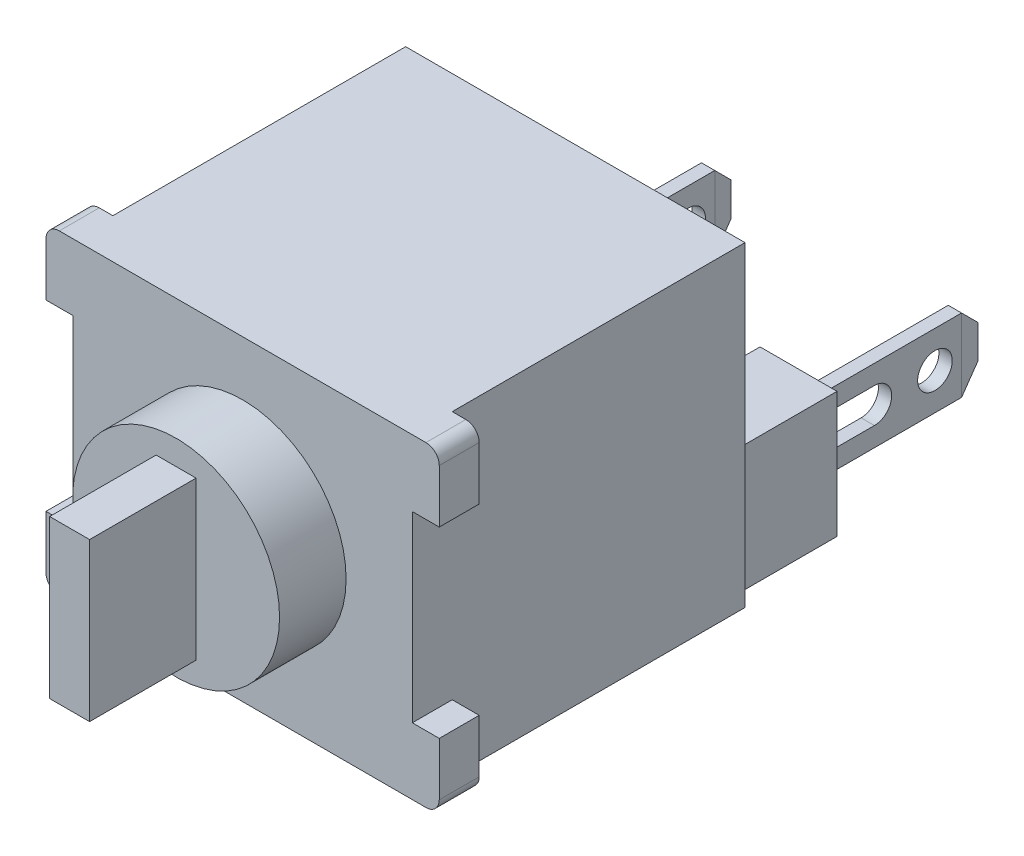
from build123d import *
from OCP.BRepFilletAPI import BRepFilletAPI_MakeChamfer

# Parameters (mm, degrees)
SKETCH1_W                          = 12.954
SKETCH1_H                          = 12.065
EXTRUDE1_DEPTH                     = 12.7
SKETCH2_W                          = 2.939197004
SKETCH2_H                          = 4.798107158
STANDOFF_DEPTH                     = 3.81
SKETCH3_W                          = 0.508
SKETCH3_H                          = 2.794
METAL_DEPTH                        = 6.731
WIRE_HOLE_REACH                    = 20.127
SKETCH4_R                          = 0.6604
CHAMFER1_SIZE                      = 0.762
CHAMFER2_SIZE                      = 0.762
CHAMFER2_SIZE2                     = 0.134361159
CHAMFER1_OF_CONNECTOR_MIRROR_SIZE  = 0.762
CHAMFER2_OF_CONNECTOR_MIRROR_SIZE  = 0.762
CHAMFER2_OF_CONNECTOR_MIRROR_SIZE2 = 0.134361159
SKETCH5_W                          = 1.0287
SKETCH5_H                          = 2.54
TABS_DEPTH                         = 1.524
FILLET1_R                          = 0.508
TEXT_2_DEPTH                       = 0.254
SKETCH7_R                          = 3.9497
PLUNGER_DEPTH                      = 2.54
SKETCH8_W                          = 1.524
SKETCH8_H                          = 6.0198
PLUNGER_I_DEPTH                    = 4.064


with BuildPart() as part:
    # Sketch1 → Extrude1 (new body)
    with BuildSketch(Plane.XY):
        Rectangle(SKETCH1_W, SKETCH1_H)
    extrude(amount=EXTRUDE1_DEPTH)

    # Sketch2 → standoff (add)
    with BuildSketch(Plane(origin=(0, 0, 0), x_dir=(-1, 0, 0), z_dir=(0, 0, -1))):
        with Locations((4.710259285, -3.336304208)):
            Rectangle(SKETCH2_W, SKETCH2_H)
    standoff = extrude(amount=STANDOFF_DEPTH)

    # Sketch3 → metal (add)
    with BuildSketch(Plane(origin=(0, 0, -3.81), x_dir=(-1, 0, 0), z_dir=(0, 0, -1))):
        with Locations((4.710259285, -3.336304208)):
            Rectangle(SKETCH3_W, SKETCH3_H)
    metal = extrude(amount=METAL_DEPTH)

    # Sketch4 → wire hole (cut, up to next)
    with BuildSketch(Plane.ZY.offset(4.964259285), mode=Mode.PRIVATE) as wire_hole_sk1:
        with Locations((-8.763, -3.336304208)):
            Circle(SKETCH4_R)
    wire_hole_tool1 = extrude(wire_hole_sk1.sketch, amount=-WIRE_HOLE_REACH, mode=Mode.PRIVATE) & part.part
    # Sketch4 → wire hole (cut, up to next)
    with BuildSketch(Plane.ZY.offset(4.964259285), mode=Mode.PRIVATE) as wire_hole_sk2:
        with BuildLine():
            Line((-4.4704, -3.996704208), (-6.4516, -3.996704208))
            ThreePointArc((-6.4516, -3.996704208), (-7.112, -3.336304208), (-6.4516, -2.675904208))
            Line((-6.4516, -2.675904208), (-4.4704, -2.675904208))
            ThreePointArc((-4.4704, -2.675904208), (-3.81, -3.336304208), (-4.4704, -3.996704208))
        make_face()
    wire_hole_tool2 = extrude(wire_hole_sk2.sketch, amount=-WIRE_HOLE_REACH, mode=Mode.PRIVATE) & part.part
    wire_hole_1 = wire_hole_tool1.solids().sort_by_distance((-4.964259, -3.336304, -8.763))[0]
    add(wire_hole_1, mode=Mode.SUBTRACT)
    wire_hole_2 = wire_hole_tool2.solids().sort_by_distance((-4.964259, -3.336304, -5.461))[0]
    add(wire_hole_2, mode=Mode.SUBTRACT)
    wire_hole = wire_hole_1 + wire_hole_2  # wire hole as one shape, for the pattern or mirror that repeats it

    # Chamfer1
    chamfer1_edges = [part.edges().sort_by_distance(p)[0] for p in [
        (-4.710259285, -1.939304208, -10.541),
        (-4.710259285, -4.733304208, -10.541),
    ]]
    chamfer(chamfer1_edges, length=CHAMFER1_SIZE)

    # Chamfer2: one chamfer whose edges measure the first distance from different faces: ONE call of the kernel's chamfer builder (chamfer() names one face for all edges)
    chamfer2_edges_1 = [part.edges().sort_by_distance(p)[0] for p in [
        (-4.456259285, -3.336304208, -10.541),
    ]]
    chamfer2_side_1 = [part.faces().sort_by_distance(p)[0] for p in [
        (-4.456259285, -3.336304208, -7.397261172),
    ]]
    chamfer2_edges_2 = [part.edges().sort_by_distance(p)[0] for p in [
        (-4.964259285, -3.336304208, -10.541),
    ]]
    chamfer2_side_2 = [part.faces().sort_by_distance(p)[0] for p in [
        (-4.964259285, -3.336304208, -7.397261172),
    ]]
    chamfer2 = BRepFilletAPI_MakeChamfer(part.part.solid().wrapped)
    for e in chamfer2_edges_1:
        chamfer2.Add(CHAMFER2_SIZE, CHAMFER2_SIZE2, e.wrapped, chamfer2_side_1[0].wrapped)  # the first distance lies on this face
    for e in chamfer2_edges_2:
        chamfer2.Add(CHAMFER2_SIZE, CHAMFER2_SIZE2, e.wrapped, chamfer2_side_2[0].wrapped)  # the first distance lies on this face
    add(Compound.cast(chamfer2.Shape()), mode=Mode.REPLACE)

    # connector mirror: standoff, metal, wire hole across plane
    add(standoff.mirror(Plane(origin=(0, 0, 0), x_dir=(0, 0, 1), z_dir=(1, 0, 0))))
    add(metal.mirror(Plane(origin=(0, 0, 0), x_dir=(0, 0, 1), z_dir=(1, 0, 0))))
    add(wire_hole.mirror(Plane(origin=(0, 0, 0), x_dir=(0, 0, 1), z_dir=(1, 0, 0))), mode=Mode.SUBTRACT)

    # Chamfer1 of connector mirror
    chamfer1_of_connector_mirror_edges = [part.edges().sort_by_distance(p)[0] for p in [
        (4.710259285, -1.939304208, -10.541),
        (4.710259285, -4.733304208, -10.541),
    ]]
    chamfer(chamfer1_of_connector_mirror_edges, length=CHAMFER1_OF_CONNECTOR_MIRROR_SIZE)

    # Chamfer2 of connector mirror: one chamfer whose edges measure the first distance from different faces: ONE call of the kernel's chamfer builder (chamfer() names one face for all edges)
    chamfer2_of_connector_mirror_edges_1 = [part.edges().sort_by_distance(p)[0] for p in [
        (4.456259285, -3.336304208, -10.541),
    ]]
    chamfer2_of_connector_mirror_side_1 = [part.faces().sort_by_distance(p)[0] for p in [
        (4.456259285, -3.336304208, -7.397261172),
    ]]
    chamfer2_of_connector_mirror_edges_2 = [part.edges().sort_by_distance(p)[0] for p in [
        (4.964259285, -3.336304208, -10.541),
    ]]
    chamfer2_of_connector_mirror_side_2 = [part.faces().sort_by_distance(p)[0] for p in [
        (4.964259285, -3.336304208, -7.397261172),
    ]]
    chamfer2_of_connector_mirror = BRepFilletAPI_MakeChamfer(part.part.solid().wrapped)
    for e in chamfer2_of_connector_mirror_edges_1:
        chamfer2_of_connector_mirror.Add(CHAMFER2_OF_CONNECTOR_MIRROR_SIZE, CHAMFER2_OF_CONNECTOR_MIRROR_SIZE2, e.wrapped, chamfer2_of_connector_mirror_side_1[0].wrapped)  # the first distance lies on this face
    for e in chamfer2_of_connector_mirror_edges_2:
        chamfer2_of_connector_mirror.Add(CHAMFER2_OF_CONNECTOR_MIRROR_SIZE, CHAMFER2_OF_CONNECTOR_MIRROR_SIZE2, e.wrapped, chamfer2_of_connector_mirror_side_2[0].wrapped)  # the first distance lies on this face
    add(Compound.cast(chamfer2_of_connector_mirror.Shape()), mode=Mode.REPLACE)

    # Sketch5 → tabs (add)
    with BuildSketch(Plane.XY.offset(12.7)):
        with Locations((6.99135, -4.7625)):
            Rectangle(SKETCH5_W, SKETCH5_H)
        with Locations((6.99135, 4.7625)):
            Rectangle(SKETCH5_W, SKETCH5_H)
        with Locations((-6.99135, 4.7625)):
            Rectangle(SKETCH5_W, SKETCH5_H)
        with Locations((-6.99135, -4.7625)):
            Rectangle(SKETCH5_W, SKETCH5_H)
    extrude(amount=-TABS_DEPTH)

    # Fillet1
    fillet1_edges = [part.edges().sort_by_distance(p)[0] for p in [
        (-7.5057, -6.0325, 11.938),
        (-7.5057, 6.0325, 11.938),
        (7.5057, 6.0325, 11.938),
        (7.5057, -6.0325, 11.938),
    ]]
    fillet(fillet1_edges, radius=FILLET1_R)

    # Sketch6 → text 2 (add)
    # profile 1 of 5: a face of its own
    with BuildSketch(Plane(origin=(0, 0, 0), x_dir=(-1, 0, 0), z_dir=(0, 0, -1))):
        with BuildLine():
            Line((-5.383171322, 1.004934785), (-5.211395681, 1.10791876))
            add(Edge.make_bspline(
                [(-5.211395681, 1.10791876), (-5.195419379, 1.081175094), (-5.1648094, 1.029935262), (-5.113747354, 0.960697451), (-5.060838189, 0.901849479), (-5.005690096, 0.853733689), (-4.948639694, 0.815852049), (-4.889314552, 0.789028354), (-4.827914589, 0.772298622), (-4.786128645, 0.770266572), (-4.765267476, 0.769252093)],
                knots=[0, 0, 0, 0, 1.272034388, 2.437168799, 3.508375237, 4.49857839, 5.41946034, 6.295179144, 7.148887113, 8, 8, 8, 8], degree=3))
            add(Edge.make_bspline(
                [(-4.765267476, 0.769252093), (-4.747451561, 0.769748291), (-4.712131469, 0.770732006), (-4.66013419, 0.780184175), (-4.609635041, 0.794705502), (-4.561674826, 0.815502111), (-4.516915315, 0.840663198), (-4.477664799, 0.871053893), (-4.443732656, 0.905078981), (-4.41597605, 0.943038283), (-4.394680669, 0.98386241), (-4.37831316, 1.025765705), (-4.369230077, 1.069406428), (-4.367861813, 1.098789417), (-4.367171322, 1.113617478)],
                knots=[0, 0, 0, 0, 1.095163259, 2.171163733, 3.241058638, 4.321873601, 5.38011039, 6.391990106, 7.366004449, 8.327778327, 9.272591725, 10.192022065, 11.087607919, 12, 12, 12, 12], degree=3))
            add(Edge.make_bspline(
                [(-4.367171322, 1.113617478), (-4.368027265, 1.130535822), (-4.369767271, 1.164928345), (-4.384474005, 1.215670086), (-4.407609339, 1.265885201), (-4.428952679, 1.296946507), (-4.440033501, 1.313072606)],
                knots=[0, 0, 0, 0, 0.938893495, 1.908633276, 2.914225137, 4, 4, 4, 4], degree=3))
            add(Edge.make_bspline(
                [(-4.440033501, 1.313072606), (-4.449131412, 1.324711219), (-4.468231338, 1.349145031), (-4.501067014, 1.385515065), (-4.539597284, 1.423030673), (-4.582503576, 1.463124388), (-4.631348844, 1.503931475), (-4.684603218, 1.547397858), (-4.74362635, 1.591870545), (-4.7850208, 1.621695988), (-4.806379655, 1.637085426)],
                knots=[0, 0, 0, 0, 0.722233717, 1.516239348, 2.393582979, 3.351407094, 4.387010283, 5.505090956, 6.712668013, 8, 8, 8, 8], degree=3))
            add(Edge.make_bspline(
                [(-4.806379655, 1.637085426), (-4.827758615, 1.652312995), (-4.868633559, 1.681426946), (-4.925795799, 1.724635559), (-4.976911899, 1.764139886), (-5.021754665, 1.800311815), (-5.060304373, 1.833156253), (-5.0928648, 1.8623578), (-5.118606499, 1.888706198), (-5.132920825, 1.905799), (-5.139347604, 1.913473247)],
                knots=[0, 0, 0, 0, 1.452282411, 2.77665338, 3.964542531, 5.026858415, 5.96415736, 6.766646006, 7.446254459, 8, 8, 8, 8], degree=3))
            add(Edge.make_bspline(
                [(-5.139347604, 1.913473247), (-5.148330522, 1.92543362), (-5.165996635, 1.9489553), (-5.18931587, 1.985719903), (-5.209136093, 2.023354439), (-5.224673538, 2.061960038), (-5.237757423, 2.100994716), (-5.246557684, 2.140967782), (-5.252068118, 2.181699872), (-5.252632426, 2.209110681), (-5.252914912, 2.222832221)],
                knots=[0, 0, 0, 0, 1.068054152, 2.10047183, 3.106115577, 4.101338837, 5.06977816, 6.043150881, 7.020423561, 8, 8, 8, 8], degree=3))
            add(Edge.make_bspline(
                [(-5.252914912, 2.222832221), (-5.252157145, 2.24433065), (-5.250657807, 2.286867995), (-5.237977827, 2.349007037), (-5.21796385, 2.408333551), (-5.189925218, 2.464260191), (-5.153780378, 2.515330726), (-5.111952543, 2.562132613), (-5.062132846, 2.601477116), (-5.007470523, 2.635853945), (-4.947638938, 2.662761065), (-4.884942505, 2.683058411), (-4.819281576, 2.6945591), (-4.774807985, 2.696209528), (-4.752241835, 2.697046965)],
                knots=[0, 0, 0, 0, 1.005424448, 1.989358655, 2.955360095, 3.929531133, 4.905563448, 5.876582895, 6.856512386, 7.866279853, 8.892233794, 9.918561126, 10.94386622, 12, 12, 12, 12], degree=3))
            add(Edge.make_bspline(
                [(-4.752241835, 2.697046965), (-4.728296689, 2.696221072), (-4.680677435, 2.694578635), (-4.610631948, 2.680298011), (-4.543192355, 2.656668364), (-4.488941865, 2.629852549), (-4.446483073, 2.603069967), (-4.414103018, 2.578674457), (-4.381290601, 2.550589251), (-4.347781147, 2.51873954), (-4.314142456, 2.482833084), (-4.279875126, 2.443115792), (-4.244899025, 2.399830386), (-4.22239848, 2.368929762), (-4.21086363, 2.353088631)],
                knots=[0, 0, 0, 0, 1.286793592, 2.559021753, 3.825965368, 5.121522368, 5.803751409, 6.523245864, 7.299691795, 8.125521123, 9.008227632, 9.944561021, 10.946284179, 12, 12, 12, 12], degree=3))
            Line((-4.21086363, 2.353088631), (-4.375719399, 2.228123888))
            add(Edge.make_bspline(
                [(-4.375719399, 2.228123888), (-4.385673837, 2.24094795), (-4.404843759, 2.265644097), (-4.433947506, 2.3002295), (-4.461378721, 2.331822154), (-4.488404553, 2.359262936), (-4.513597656, 2.384054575), (-4.538049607, 2.405280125), (-4.561408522, 2.423147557), (-4.590853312, 2.442215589), (-4.627845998, 2.461116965), (-4.674282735, 2.477111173), (-4.722810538, 2.486722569), (-4.755862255, 2.487993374), (-4.772594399, 2.488636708)],
                knots=[0, 0, 0, 0, 1.181633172, 2.275549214, 3.290209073, 4.226197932, 5.078386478, 5.862611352, 6.581680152, 7.217281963, 8.414376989, 9.595101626, 10.782541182, 12, 12, 12, 12], degree=3))
            add(Edge.make_bspline(
                [(-4.772594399, 2.488636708), (-4.793585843, 2.48793323), (-4.834065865, 2.486576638), (-4.891536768, 2.471760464), (-4.943262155, 2.448432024), (-4.987706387, 2.415737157), (-5.024710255, 2.377000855), (-5.051477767, 2.332425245), (-5.06758872, 2.283203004), (-5.069554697, 2.248867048), (-5.070555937, 2.231380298)],
                knots=[0, 0, 0, 0, 1.14458467, 2.207223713, 3.21896685, 4.227309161, 5.202851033, 6.127160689, 7.046193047, 8, 8, 8, 8], degree=3))
            add(Edge.make_bspline(
                [(-5.070555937, 2.231380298), (-5.070327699, 2.220493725), (-5.06987085, 2.198702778), (-5.063499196, 2.166509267), (-5.055313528, 2.134397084), (-5.042342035, 2.102510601), (-5.024434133, 2.070292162), (-5.000917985, 2.03718697), (-4.971301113, 2.002903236), (-4.948614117, 1.980605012), (-4.936636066, 1.968832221)],
                knots=[0, 0, 0, 0, 0.858281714, 1.717966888, 2.583508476, 3.4729293, 4.427298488, 5.488583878, 6.674047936, 8, 8, 8, 8], degree=3))
            add(Edge.make_bspline(
                [(-4.936636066, 1.968832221), (-4.932188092, 1.964862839), (-4.921620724, 1.955432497), (-4.902301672, 1.939993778), (-4.876789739, 1.920949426), (-4.845751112, 1.89738559), (-4.80861349, 1.870051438), (-4.765372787, 1.839296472), (-4.716511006, 1.804122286), (-4.681838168, 1.779530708), (-4.663504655, 1.766527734)],
                knots=[0, 0, 0, 0, 0.420754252, 0.999615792, 1.744751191, 2.668019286, 3.750313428, 4.999500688, 6.413464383, 8, 8, 8, 8], degree=3))
            add(Edge.make_bspline(
                [(-4.663504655, 1.766527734), (-4.641451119, 1.75047995), (-4.598747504, 1.719405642), (-4.537986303, 1.672718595), (-4.482893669, 1.627057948), (-4.433276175, 1.582715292), (-4.388643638, 1.540026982), (-4.349491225, 1.498479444), (-4.315419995, 1.458370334), (-4.278739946, 1.406947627), (-4.241259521, 1.343792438), (-4.209071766, 1.2664149), (-4.188775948, 1.18873658), (-4.186121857, 1.136527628), (-4.184812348, 1.110768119)],
                knots=[0, 0, 0, 0, 1.163667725, 2.253281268, 3.268753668, 4.215851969, 5.092017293, 5.902905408, 6.650798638, 7.335211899, 8.59617414, 9.77448103, 10.901945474, 12, 12, 12, 12], degree=3))
            add(Edge.make_bspline(
                [(-4.184812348, 1.110768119), (-4.185193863, 1.092550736), (-4.185949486, 1.056469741), (-4.194635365, 1.003489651), (-4.207361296, 0.9520331), (-4.22654177, 0.902736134), (-4.249952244, 0.854696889), (-4.279657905, 0.809175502), (-4.314090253, 0.765164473), (-4.353588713, 0.723837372), (-4.396809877, 0.685899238), (-4.442491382, 0.652151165), (-4.490707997, 0.624011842), (-4.541198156, 0.601049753), (-4.593973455, 0.583090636), (-4.649016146, 0.570078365), (-4.706416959, 0.562092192), (-4.745431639, 0.561263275), (-4.765267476, 0.560841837)],
                knots=[0, 0, 0, 0, 0.983748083, 1.948392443, 2.894712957, 3.844097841, 4.80183111, 5.778335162, 6.776009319, 7.81870978, 8.863265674, 9.881300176, 10.883814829, 11.87499822, 12.874611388, 13.892143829, 14.928324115, 16, 16, 16, 16], degree=3))
            add(Edge.make_bspline(
                [(-4.765267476, 0.560841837), (-4.780615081, 0.561138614), (-4.811117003, 0.561728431), (-4.856232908, 0.566942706), (-4.900437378, 0.574320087), (-4.943175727, 0.586032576), (-4.98499859, 0.600243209), (-5.02572407, 0.617740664), (-5.065371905, 0.63870928), (-5.104164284, 0.662683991), (-5.142002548, 0.690584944), (-5.178531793, 0.723081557), (-5.214950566, 0.759277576), (-5.250183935, 0.800155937), (-5.284944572, 0.845056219), (-5.318547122, 0.89439851), (-5.351687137, 0.947914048), (-5.372480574, 0.985572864), (-5.383171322, 1.004934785)],
                knots=[0, 0, 0, 0, 0.915332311, 1.819136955, 2.706846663, 3.586547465, 4.459518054, 5.340707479, 6.227863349, 7.133153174, 8.059268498, 9.028702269, 10.047606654, 11.120612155, 12.245963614, 13.433783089, 14.680604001, 16, 16, 16, 16], degree=3))
        make_face()
    # profile 2 of 5: a face of its own
    with BuildSketch(Plane(origin=(0, 0, 0), x_dir=(-1, 0, 0), z_dir=(0, 0, -1))):
        Polygon((-2.934350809, 2.644944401), (-1.996504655, 0.612944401), (-2.19473863, 0.612944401), (-2.495142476, 1.264226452), (-3.416299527, 1.264226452), (-3.72525145, 0.612944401), (-3.924299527, 0.612944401), (-2.960402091, 2.644944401), align=None)
        Polygon((-2.949411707, 2.248883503), (-3.317386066, 1.472636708), (-2.591206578, 1.472636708), align=None, mode=Mode.SUBTRACT)
    # profile 3 of 5: a face of its own
    with BuildSketch(Plane(origin=(0, 0, 0), x_dir=(-1, 0, 0), z_dir=(0, 0, -1))):
        Polygon((-1.631786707, 0.612944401), (-1.631786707, 2.644944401), (-1.593523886, 2.644944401), (-0.251068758, 1.045639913), (-0.251068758, 2.644944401), (-0.068709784, 2.644944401), (-0.068709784, 0.612944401), (-0.110229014, 0.612944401), (-1.449427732, 2.208585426), (-1.449427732, 0.612944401), align=None)
    # profile 4 of 5: a face of its own
    with BuildSketch(Plane(origin=(0, 0, 0), x_dir=(-1, 0, 0), z_dir=(0, 0, -1))):
        Polygon((0.322059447, 2.644944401), (0.510524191, 2.644944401), (0.908213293, 1.154729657), (1.499658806, 2.644944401), (1.52611714, 2.644944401), (2.106572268, 1.164905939), (2.506296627, 2.644944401), (2.692726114, 2.644944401), (2.144835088, 0.612944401), (2.118783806, 0.612944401), (1.507392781, 2.167066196), (0.888674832, 0.612944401), (0.86262355, 0.612944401), align=None)
    # profile 5 of 5: a face of its own
    with BuildSketch(Plane(origin=(0, 0, 0), x_dir=(-1, 0, 0), z_dir=(0, 0, -1))):
        Polygon((3.891085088, 2.644944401), (4.828931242, 0.612944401), (4.630697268, 0.612944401), (4.330293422, 1.264226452), (3.40913637, 1.264226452), (3.100184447, 0.612944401), (2.90113637, 0.612944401), (3.865033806, 2.644944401), align=None)
        Polygon((3.876024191, 2.248883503), (3.508049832, 1.472636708), (4.234229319, 1.472636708), align=None, mode=Mode.SUBTRACT)
    extrude(amount=TEXT_2_DEPTH)

    # Sketch7 → plunger (add)
    with BuildSketch(Plane.XY.offset(12.7)):
        Circle(SKETCH7_R)
    extrude(amount=PLUNGER_DEPTH)

    # Sketch8 → plunger I (add)
    with BuildSketch(Plane.XY.offset(15.24)):
        Rectangle(SKETCH8_W, SKETCH8_H)
    extrude(amount=PLUNGER_I_DEPTH)


solid = part.part
